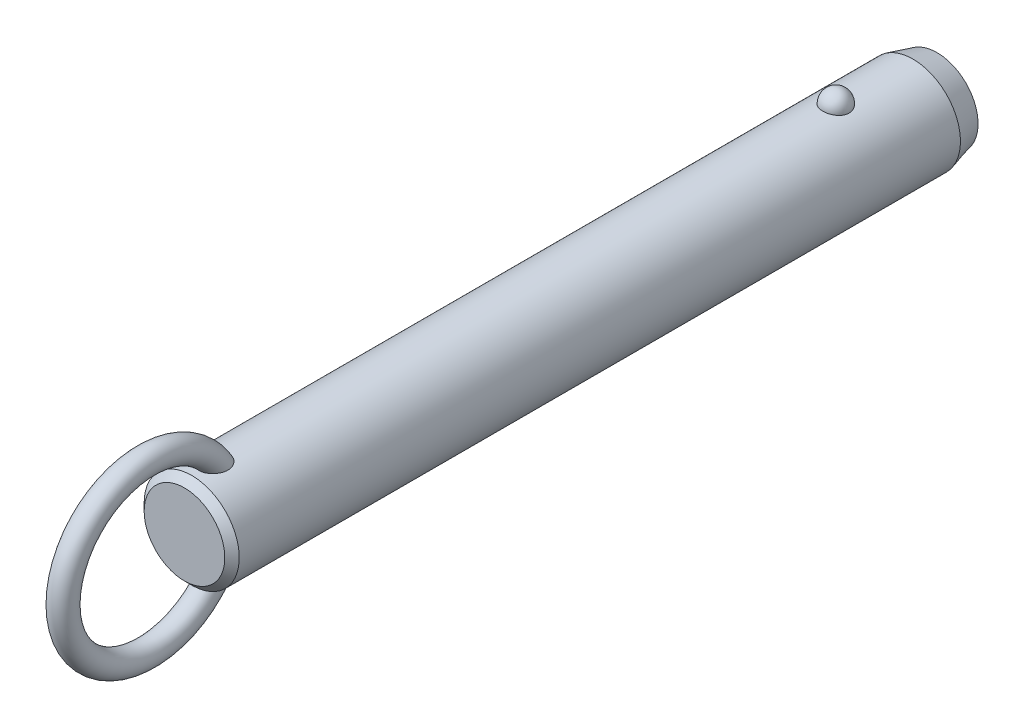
ISO-10303-21;
HEADER;
FILE_DESCRIPTION(('STEP AP214'),'2;1');
FILE_NAME('part.step','',(''),(''),'','','');
FILE_SCHEMA(('AUTOMOTIVE_DESIGN { 1 0 10303 214 1 1 1 1 }'));
ENDSEC;
DATA;
#1=APPLICATION_CONTEXT('core data for automotive mechanical design processes');
#2=APPLICATION_PROTOCOL_DEFINITION('international standard','automotive_design',2000,#1);
#3=PRODUCT_CONTEXT('',#1,'mechanical');
#4=PRODUCT('Part','Part','',(#3));
#5=PRODUCT_RELATED_PRODUCT_CATEGORY('part','',(#4));
#6=PRODUCT_DEFINITION_FORMATION('','',#4);
#7=PRODUCT_DEFINITION_CONTEXT('part definition',#1,'design');
#8=PRODUCT_DEFINITION('design','',#6,#7);
#9=PRODUCT_DEFINITION_SHAPE('','',#8);
#10=(LENGTH_UNIT() NAMED_UNIT(*) SI_UNIT(.MILLI.,.METRE.));
#11=(NAMED_UNIT(*) PLANE_ANGLE_UNIT() SI_UNIT($,.RADIAN.));
#12=(NAMED_UNIT(*) SI_UNIT($,.STERADIAN.) SOLID_ANGLE_UNIT());
#13=UNCERTAINTY_MEASURE_WITH_UNIT(LENGTH_MEASURE(1.E-05),#10,'distance_accuracy_value','');
#14=(GEOMETRIC_REPRESENTATION_CONTEXT(3) GLOBAL_UNCERTAINTY_ASSIGNED_CONTEXT((#13)) GLOBAL_UNIT_ASSIGNED_CONTEXT((#10,
#11,#12)) REPRESENTATION_CONTEXT('',''));
#15=CARTESIAN_POINT('',(0.,0.,0.));
#16=DIRECTION('',(0.,0.,1.));
#17=DIRECTION('',(1.,0.,0.));
#18=AXIS2_PLACEMENT_3D('',#15,#16,#17);
#19=CARTESIAN_POINT('',(0.,0.,96.5));
#20=DIRECTION('',(0.,0.,-1.));
#21=DIRECTION('',(-1.,0.,0.));
#22=AXIS2_PLACEMENT_3D('',#19,#20,#21);
#23=CYLINDRICAL_SURFACE('',#22,7.9);
#24=CARTESIAN_POINT('',(2.1785689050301,7.59367088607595,-2.19999999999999));
#25=CARTESIAN_POINT('',(2.17856679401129,7.59367269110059,-2.07701843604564));
#26=CARTESIAN_POINT('',(2.16853481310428,7.59657145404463,-1.95401006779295));
#27=CARTESIAN_POINT('',(2.12864689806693,7.607843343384,-1.71147811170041));
#28=CARTESIAN_POINT('',(2.09878338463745,7.61621856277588,-1.59195587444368));
#29=CARTESIAN_POINT('',(2.0199931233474,7.63749180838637,-1.3598563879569));
#30=CARTESIAN_POINT('',(1.97107475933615,7.6503878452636,-1.24727610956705));
#31=CARTESIAN_POINT('',(1.85539377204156,7.67926115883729,-1.03213234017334));
#32=CARTESIAN_POINT('',(1.78863158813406,7.69523835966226,-0.929568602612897));
#33=CARTESIAN_POINT('',(1.63856494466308,7.7285848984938,-0.736786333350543));
#34=CARTESIAN_POINT('',(1.55518140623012,7.7459606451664,-0.646630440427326));
#35=CARTESIAN_POINT('',(1.37422937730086,7.78009978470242,-0.481747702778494));
#36=CARTESIAN_POINT('',(1.27666086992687,7.79686317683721,-0.407020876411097));
#37=CARTESIAN_POINT('',(1.07024728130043,7.82786153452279,-0.275278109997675));
#38=CARTESIAN_POINT('',(0.961434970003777,7.84210353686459,-0.218212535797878));
#39=CARTESIAN_POINT('',(0.735351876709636,7.86652194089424,-0.123146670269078));
#40=CARTESIAN_POINT('',(0.618082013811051,7.87669878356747,-0.085144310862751));
#41=CARTESIAN_POINT('',(0.380637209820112,7.89170521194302,-0.0298158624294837));
#42=CARTESIAN_POINT('',(0.260550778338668,7.89662650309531,-0.0121347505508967));
#43=CARTESIAN_POINT('',(0.0190117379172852,7.90090003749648,0.00324379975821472));
#44=CARTESIAN_POINT('',(-0.102440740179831,7.90025280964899,0.00094313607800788));
#45=CARTESIAN_POINT('',(-0.341452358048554,7.89351056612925,-0.0233955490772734));
#46=CARTESIAN_POINT('',(-0.459042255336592,7.88749257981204,-0.0451545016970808));
#47=CARTESIAN_POINT('',(-0.688796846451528,7.87075812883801,-0.107408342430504));
#48=CARTESIAN_POINT('',(-0.800961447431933,7.86004158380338,-0.147903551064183));
#49=CARTESIAN_POINT('',(-1.01743634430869,7.83497131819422,-0.246799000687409));
#50=CARTESIAN_POINT('',(-1.12169791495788,7.82059709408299,-0.305300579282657));
#51=CARTESIAN_POINT('',(-1.31891765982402,7.78976470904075,-0.438549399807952));
#52=CARTESIAN_POINT('',(-1.41187469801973,7.77330633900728,-0.513298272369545));
#53=CARTESIAN_POINT('',(-1.58577142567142,7.73972434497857,-0.678622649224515));
#54=CARTESIAN_POINT('',(-1.66645140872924,7.72259402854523,-0.769470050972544));
#55=CARTESIAN_POINT('',(-1.81161503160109,7.68983776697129,-0.963538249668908));
#56=CARTESIAN_POINT('',(-1.87609753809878,7.6742119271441,-1.06675991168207));
#57=CARTESIAN_POINT('',(-1.98790138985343,7.6460202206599,-1.28401170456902));
#58=CARTESIAN_POINT('',(-2.03501994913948,7.63349104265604,-1.39815107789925));
#59=CARTESIAN_POINT('',(-2.10986724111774,7.6131449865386,-1.63301784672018));
#60=CARTESIAN_POINT('',(-2.1375965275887,7.60532797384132,-1.75374505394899));
#61=CARTESIAN_POINT('',(-2.17289256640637,7.5953195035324,-1.99782562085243));
#62=CARTESIAN_POINT('',(-2.18054294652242,7.59310471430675,-2.12116592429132));
#63=CARTESIAN_POINT('',(-2.17572919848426,7.59448538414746,-2.36741799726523));
#64=CARTESIAN_POINT('',(-2.1632656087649,7.59808068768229,-2.49032977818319));
#65=CARTESIAN_POINT('',(-2.11865035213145,7.61064035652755,-2.73161015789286));
#66=CARTESIAN_POINT('',(-2.08659579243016,7.61957823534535,-2.84999812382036));
#67=CARTESIAN_POINT('',(-2.00367799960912,7.64179982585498,-3.07955956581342));
#68=CARTESIAN_POINT('',(-1.9528140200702,7.65508371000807,-3.19073275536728));
#69=CARTESIAN_POINT('',(-1.83321113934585,7.68460381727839,-3.40337899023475));
#70=CARTESIAN_POINT('',(-1.76437735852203,7.70085556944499,-3.50479651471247));
#71=CARTESIAN_POINT('',(-1.61069526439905,7.73445734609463,-3.69446912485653));
#72=CARTESIAN_POINT('',(-1.52584634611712,7.75180741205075,-3.78272371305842));
#73=CARTESIAN_POINT('',(-1.34198059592,7.78574608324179,-3.94393987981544));
#74=CARTESIAN_POINT('',(-1.24291308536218,7.80233167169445,-4.01684434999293));
#75=CARTESIAN_POINT('',(-1.03352039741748,7.83281625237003,-4.14489386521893));
#76=CARTESIAN_POINT('',(-0.92319600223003,7.84671543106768,-4.20004014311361));
#77=CARTESIAN_POINT('',(-0.695822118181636,7.87011575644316,-4.29042017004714));
#78=CARTESIAN_POINT('',(-0.578872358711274,7.87966903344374,-4.32589112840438));
#79=CARTESIAN_POINT('',(-0.340410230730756,7.8935652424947,-4.37692226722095));
#80=CARTESIAN_POINT('',(-0.218898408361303,7.89790879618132,-4.39248482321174));
#81=CARTESIAN_POINT('',(0.0228107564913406,7.90087453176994,-4.40314405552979));
#82=CARTESIAN_POINT('',(0.142990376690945,7.89960185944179,-4.39861683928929));
#83=CARTESIAN_POINT('',(0.380829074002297,7.89171262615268,-4.37008293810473));
#84=CARTESIAN_POINT('',(0.498488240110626,7.8850962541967,-4.34607694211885));
#85=CARTESIAN_POINT('',(0.727535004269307,7.86726442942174,-4.27939317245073));
#86=CARTESIAN_POINT('',(0.838944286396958,7.85606616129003,-4.236785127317));
#87=CARTESIAN_POINT('',(1.05295421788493,7.83025654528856,-4.13408348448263));
#88=CARTESIAN_POINT('',(1.15555431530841,7.81564498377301,-4.07398879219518));
#89=CARTESIAN_POINT('',(1.35076763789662,7.7843022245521,-3.93687432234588));
#90=CARTESIAN_POINT('',(1.4432046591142,7.76754209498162,-3.85961036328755));
#91=CARTESIAN_POINT('',(1.6139111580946,7.73387857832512,-3.69076949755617));
#92=CARTESIAN_POINT('',(1.6921781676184,7.71697516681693,-3.59919010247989));
#93=CARTESIAN_POINT('',(1.83380875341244,7.6845643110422,-3.40247278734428));
#94=CARTESIAN_POINT('',(1.89689280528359,7.66908588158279,-3.29712873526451));
#95=CARTESIAN_POINT('',(2.0047823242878,7.64159441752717,-3.07707931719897));
#96=CARTESIAN_POINT('',(2.0495945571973,7.62958010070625,-2.96237743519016));
#97=CARTESIAN_POINT('',(2.11580183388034,7.61146617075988,-2.74040519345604));
#98=CARTESIAN_POINT('',(2.13929812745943,7.60484503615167,-2.63379846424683));
#99=CARTESIAN_POINT('',(2.17068242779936,7.59594664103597,-2.41813481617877));
#100=CARTESIAN_POINT('',(2.17857077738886,7.59366928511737,-2.30907795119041));
#101=CARTESIAN_POINT('',(2.1785689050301,7.59367088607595,-2.19999999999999));
#102=B_SPLINE_CURVE_WITH_KNOTS('',3,(#24,#25,#26,#27,#28,#29,#30,#31,#32,#33,#34,#35,#36,#37,
#38,#39,#40,#41,#42,#43,#44,#45,#46,#47,#48,#49,#50,#51,#52,#53,#54,#55,#56,#57,#58,#59,#60,#61,
#62,#63,#64,#65,#66,#67,#68,#69,#70,#71,#72,#73,#74,#75,#76,#77,#78,#79,#80,#81,#82,#83,#84,#85,
#86,#87,#88,#89,#90,#91,#92,#93,#94,#95,#96,#97,#98,#99,#100,#101),.UNSPECIFIED.,.T.,.F.,(4,2,2,
2,2,2,2,2,2,2,2,2,2,2,2,2,2,2,2,2,2,2,2,2,2,2,2,2,2,2,2,2,2,2,2,2,2,2,4),(0.,0.368552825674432,
0.737246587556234,1.10577831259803,1.4743009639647,1.8446206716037,2.21494081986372,
2.5842105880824,2.95344028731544,3.31611630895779,3.67875788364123,4.03628044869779,
4.39380913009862,4.75338791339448,5.11300280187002,5.47939989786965,5.8458226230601,
6.21639834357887,6.58696347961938,6.95598276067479,7.32499216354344,7.69218715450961,
8.0593967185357,8.42858578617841,8.79778880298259,9.16834203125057,9.5388695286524,
9.90482699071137,10.2707407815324,10.6298333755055,10.9889132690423,11.3466585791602,
11.7044262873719,12.0676511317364,12.4309391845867,12.8004764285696,13.1698767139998,
13.4967701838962,13.8236564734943),.UNSPECIFIED.);
#103=CARTESIAN_POINT('',(2.1785689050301,7.59367088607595,-2.19999999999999));
#104=VERTEX_POINT('',#103);
#105=EDGE_CURVE('E41',#104,#104,#102,.T.);
#106=ORIENTED_EDGE('',*,*,#105,.T.);
#107=EDGE_LOOP('',(#106));
#108=FACE_BOUND('',#107,.T.);
#109=CARTESIAN_POINT('',(0.,0.,104.82));
#110=DIRECTION('',(0.,0.,1.));
#111=DIRECTION('',(1.,0.,0.));
#112=AXIS2_PLACEMENT_3D('',#109,#110,#111);
#113=CIRCLE('',#112,7.9);
#114=CARTESIAN_POINT('',(-7.90000000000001,0.,104.82));
#115=VERTEX_POINT('',#114);
#116=EDGE_CURVE('E10',#115,#115,#113,.F.);
#117=ORIENTED_EDGE('',*,*,#116,.T.);
#118=EDGE_LOOP('',(#117));
#119=FACE_BOUND('',#118,.T.);
#120=CARTESIAN_POINT('',(-0.630969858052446,-7.87476203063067,98.7124322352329));
#121=CARTESIAN_POINT('',(-0.73418033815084,-7.8664899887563,98.747285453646));
#122=CARTESIAN_POINT('',(-0.834476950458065,-7.85639291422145,98.7908160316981));
#123=CARTESIAN_POINT('',(-1.02620356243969,-7.83366343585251,98.8940948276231));
#124=CARTESIAN_POINT('',(-1.1176141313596,-7.82102565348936,98.9538775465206));
#125=CARTESIAN_POINT('',(-1.28877277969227,-7.79464922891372,99.0878390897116));
#126=CARTESIAN_POINT('',(-1.36854014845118,-7.78091246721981,99.161993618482));
#127=CARTESIAN_POINT('',(-1.5146152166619,-7.75380398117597,99.3224941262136));
#128=CARTESIAN_POINT('',(-1.58092966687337,-7.74043207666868,99.4088339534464));
#129=CARTESIAN_POINT('',(-1.70019064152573,-7.71512522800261,99.5929784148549));
#130=CARTESIAN_POINT('',(-1.75284037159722,-7.70322473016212,99.6909792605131));
#131=CARTESIAN_POINT('',(-1.84263464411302,-7.68224112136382,99.8941029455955));
#132=CARTESIAN_POINT('',(-1.87977299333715,-7.6731591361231,99.9992286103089));
#133=CARTESIAN_POINT('',(-1.94152728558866,-7.65777930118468,100.223284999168));
#134=CARTESIAN_POINT('',(-1.96475471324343,-7.65179654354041,100.342616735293));
#135=CARTESIAN_POINT('',(-1.99449499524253,-7.64409642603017,100.58342986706));
#136=CARTESIAN_POINT('',(-2.0010005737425,-7.64238092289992,100.704912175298));
#137=CARTESIAN_POINT('',(-1.99856014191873,-7.64302120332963,100.968340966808));
#138=CARTESIAN_POINT('',(-1.98680021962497,-7.64611845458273,101.11025654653));
#139=CARTESIAN_POINT('',(-1.94457772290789,-7.65696186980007,101.391118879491));
#140=CARTESIAN_POINT('',(-1.91409393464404,-7.66471330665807,101.530062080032));
#141=CARTESIAN_POINT('',(-1.82768670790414,-7.68582947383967,101.831939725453));
#142=CARTESIAN_POINT('',(-1.76772963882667,-7.70003779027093,101.993686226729));
#143=CARTESIAN_POINT('',(-1.65998501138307,-7.72371550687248,102.227695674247));
#144=CARTESIAN_POINT('',(-1.621079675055,-7.73200670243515,102.304297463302));
#145=CARTESIAN_POINT('',(-1.53727726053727,-7.74910377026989,102.454079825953));
#146=CARTESIAN_POINT('',(-1.49238215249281,-7.75790947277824,102.527261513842));
#147=CARTESIAN_POINT('',(-1.3739705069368,-7.77993338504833,102.70288382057));
#148=CARTESIAN_POINT('',(-1.29690364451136,-7.79328473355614,102.802955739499));
#149=CARTESIAN_POINT('',(-1.1288548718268,-7.81939266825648,102.990714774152));
#150=CARTESIAN_POINT('',(-1.03789926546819,-7.83215032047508,103.078424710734));
#151=CARTESIAN_POINT('',(-0.869532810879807,-7.85231710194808,103.213414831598));
#152=CARTESIAN_POINT('',(-0.795716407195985,-7.86021093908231,103.265076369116));
#153=CARTESIAN_POINT('',(-0.64081313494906,-7.87434920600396,103.356381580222));
#154=CARTESIAN_POINT('',(-0.55973779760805,-7.88059619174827,103.39604389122));
#155=CARTESIAN_POINT('',(-0.406456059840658,-7.88984116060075,103.454300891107));
#156=CARTESIAN_POINT('',(-0.335227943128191,-7.89321892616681,103.475384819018));
#157=CARTESIAN_POINT('',(-0.19019307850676,-7.89804235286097,103.50541418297));
#158=CARTESIAN_POINT('',(-0.11638863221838,-7.89948969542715,103.514370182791));
#159=CARTESIAN_POINT('',(0.0318414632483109,-7.90028409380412,103.519291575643));
#160=CARTESIAN_POINT('',(0.106268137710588,-7.89962640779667,103.515227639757));
#161=CARTESIAN_POINT('',(0.253290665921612,-7.8962818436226,103.494461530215));
#162=CARTESIAN_POINT('',(0.32588518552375,-7.8935935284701,103.477750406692));
#163=CARTESIAN_POINT('',(0.481441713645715,-7.88577340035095,103.428738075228));
#164=CARTESIAN_POINT('',(0.563611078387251,-7.88026321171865,103.394005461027));
#165=CARTESIAN_POINT('',(0.721129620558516,-7.86741729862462,103.311796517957));
#166=CARTESIAN_POINT('',(0.796466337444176,-7.86007832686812,103.264297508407));
#167=CARTESIAN_POINT('',(0.971456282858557,-7.84073285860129,103.136513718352));
#168=CARTESIAN_POINT('',(1.0671968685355,-7.82809461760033,103.051004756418));
#169=CARTESIAN_POINT('',(1.24418921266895,-7.80192439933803,102.866232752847));
#170=CARTESIAN_POINT('',(1.32540832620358,-7.78839049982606,102.766939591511));
#171=CARTESIAN_POINT('',(1.45199971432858,-7.76559693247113,102.589576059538));
#172=CARTESIAN_POINT('',(1.50085649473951,-7.75626094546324,102.513954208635));
#173=CARTESIAN_POINT('',(1.59197749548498,-7.7380727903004,102.358742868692));
#174=CARTESIAN_POINT('',(1.63423919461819,-7.72922080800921,102.279151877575));
#175=CARTESIAN_POINT('',(1.71222612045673,-7.71231959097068,102.116664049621));
#176=CARTESIAN_POINT('',(1.74794516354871,-7.70427111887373,102.033764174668));
#177=CARTESIAN_POINT('',(1.81270113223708,-7.68929240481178,101.865296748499));
#178=CARTESIAN_POINT('',(1.84173789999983,-7.68236218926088,101.779729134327));
#179=CARTESIAN_POINT('',(1.89322698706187,-7.66983757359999,101.60528702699));
#180=CARTESIAN_POINT('',(1.91558744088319,-7.66426199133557,101.516383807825));
#181=CARTESIAN_POINT('',(1.95281367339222,-7.65485915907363,101.336969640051));
#182=CARTESIAN_POINT('',(1.96767946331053,-7.65103190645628,101.246458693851));
#183=CARTESIAN_POINT('',(2.00021456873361,-7.64262981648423,100.973732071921));
#184=CARTESIAN_POINT('',(2.00600691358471,-7.6410871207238,100.789709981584));
#185=CARTESIAN_POINT('',(1.98445334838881,-7.64669564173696,100.476501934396));
#186=CARTESIAN_POINT('',(1.96607186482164,-7.65149688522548,100.346618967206));
#187=CARTESIAN_POINT('',(1.90884967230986,-7.6659762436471,100.091632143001));
#188=CARTESIAN_POINT('',(1.8700210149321,-7.67565148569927,99.966525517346));
#189=CARTESIAN_POINT('',(1.77063986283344,-7.69918471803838,99.7245401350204));
#190=CARTESIAN_POINT('',(1.70993724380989,-7.71307150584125,99.6077250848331));
#191=CARTESIAN_POINT('',(1.5673307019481,-7.74330306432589,99.3881444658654));
#192=CARTESIAN_POINT('',(1.48543692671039,-7.75964665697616,99.2853722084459));
#193=CARTESIAN_POINT('',(1.31346177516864,-7.79047523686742,99.1093800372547));
#194=CARTESIAN_POINT('',(1.22547278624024,-7.80495298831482,99.0341066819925));
#195=CARTESIAN_POINT('',(1.03724352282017,-7.83218597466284,98.9004864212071));
#196=CARTESIAN_POINT('',(0.937008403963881,-7.84494192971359,98.8421324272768));
#197=CARTESIAN_POINT('',(0.733599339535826,-7.86649045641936,98.7470270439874));
#198=CARTESIAN_POINT('',(0.630941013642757,-7.87547134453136,98.7092109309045));
#199=CARTESIAN_POINT('',(0.420465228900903,-7.88950708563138,98.6511160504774));
#200=CARTESIAN_POINT('',(0.312645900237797,-7.89456050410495,98.6308436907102));
#201=CARTESIAN_POINT('',(0.0960869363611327,-7.9001518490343,98.6084559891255));
#202=CARTESIAN_POINT('',(-0.0126341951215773,-7.90073226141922,98.6061698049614));
#203=CARTESIAN_POINT('',(-0.228766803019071,-7.89742350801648,98.6193678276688));
#204=CARTESIAN_POINT('',(-0.336180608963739,-7.89354403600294,98.6348134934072));
#205=CARTESIAN_POINT('',(-0.473410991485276,-7.88586871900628,98.6662177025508));
#206=CARTESIAN_POINT('',(-0.50525779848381,-7.88388984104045,98.6743541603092));
#207=CARTESIAN_POINT('',(-0.5684812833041,-7.87958326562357,98.6922083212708));
#208=CARTESIAN_POINT('',(-0.599857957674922,-7.87725556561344,98.7019260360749));
#209=CARTESIAN_POINT('',(-0.630969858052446,-7.87476203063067,98.7124322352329));
#210=B_SPLINE_CURVE_WITH_KNOTS('',3,(#120,#121,#122,#123,#124,#125,#126,#127,#128,#129,#130,
#131,#132,#133,#134,#135,#136,#137,#138,#139,#140,#141,#142,#143,#144,#145,#146,#147,#148,#149,
#150,#151,#152,#153,#154,#155,#156,#157,#158,#159,#160,#161,#162,#163,#164,#165,#166,#167,#168,
#169,#170,#171,#172,#173,#174,#175,#176,#177,#178,#179,#180,#181,#182,#183,#184,#185,#186,#187,
#188,#189,#190,#191,#192,#193,#194,#195,#196,#197,#198,#199,#200,#201,#202,#203,#204,#205,#206,
#207,#208,#209),.UNSPECIFIED.,.T.,.F.,(4,2,2,2,2,2,2,2,2,2,2,2,2,2,2,2,2,2,2,2,2,2,2,2,2,2,2,2,
2,2,2,2,2,2,2,2,2,2,2,2,2,2,2,2,4),(0.,0.327622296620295,0.655945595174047,0.983718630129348,
1.3113267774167,1.64554655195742,1.9798996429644,2.3436572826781,2.70757317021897,
3.13333684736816,3.55958380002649,4.07655306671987,4.3352789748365,4.59391999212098,
4.97382437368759,5.35301797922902,5.62348245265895,5.89352465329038,6.11565959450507,
6.33760092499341,6.56004255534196,6.78264174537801,7.04930844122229,7.31645206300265,
7.70130871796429,8.08701995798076,8.3582450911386,8.62957365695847,8.90115735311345,
9.17274746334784,9.44791855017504,9.72308922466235,10.2715298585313,10.6638393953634,
11.0559179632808,11.4507403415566,11.845374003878,12.1936425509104,12.5417649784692,
12.8695063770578,13.1973674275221,13.5221104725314,13.8461490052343,13.9449071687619,
14.0436660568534),.UNSPECIFIED.);
#211=CARTESIAN_POINT('',(-0.630969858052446,-7.87476203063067,98.7124322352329));
#212=VERTEX_POINT('',#211);
#213=EDGE_CURVE('E59',#212,#212,#210,.T.);
#214=ORIENTED_EDGE('',*,*,#213,.T.);
#215=EDGE_LOOP('',(#214));
#216=FACE_BOUND('',#215,.T.);
#217=CARTESIAN_POINT('',(-0.630969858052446,7.87476203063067,98.7124322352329));
#218=CARTESIAN_POINT('',(-0.528918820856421,7.88293636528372,98.6779798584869));
#219=CARTESIAN_POINT('',(-0.42374551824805,7.8893481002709,98.651915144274));
#220=CARTESIAN_POINT('',(-0.210236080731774,7.8979273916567,98.6172825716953));
#221=CARTESIAN_POINT('',(-0.10189380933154,7.90008607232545,98.6087513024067));
#222=CARTESIAN_POINT('',(0.114660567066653,7.89990877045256,98.6094570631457));
#223=CARTESIAN_POINT('',(0.222872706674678,7.89757640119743,98.6186798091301));
#224=CARTESIAN_POINT('',(0.436107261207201,7.88867538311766,98.6546525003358));
#225=CARTESIAN_POINT('',(0.541131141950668,7.8821087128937,98.6813942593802));
#226=CARTESIAN_POINT('',(0.745085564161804,7.86545130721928,98.7517561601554));
#227=CARTESIAN_POINT('',(0.844015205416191,7.85536005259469,98.7953787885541));
#228=CARTESIAN_POINT('',(1.03299167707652,7.83275153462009,98.8983796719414));
#229=CARTESIAN_POINT('',(1.12303841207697,7.8202342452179,98.9577580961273));
#230=CARTESIAN_POINT('',(1.29214734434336,7.79408219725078,99.0908647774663));
#231=CARTESIAN_POINT('',(1.37116907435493,7.78044359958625,99.1646436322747));
#232=CARTESIAN_POINT('',(1.51597677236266,7.75353170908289,99.3242353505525));
#233=CARTESIAN_POINT('',(1.58176261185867,7.74025841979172,99.4100483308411));
#234=CARTESIAN_POINT('',(1.70057386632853,7.71504069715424,99.593644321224));
#235=CARTESIAN_POINT('',(1.75320073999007,7.70314257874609,99.6916906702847));
#236=CARTESIAN_POINT('',(1.84293767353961,7.68216822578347,99.8948931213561));
#237=CARTESIAN_POINT('',(1.88004278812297,7.67309289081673,100.000051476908));
#238=CARTESIAN_POINT('',(1.9417232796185,7.6577294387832,100.224167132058));
#239=CARTESIAN_POINT('',(1.96491037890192,7.65175648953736,100.343524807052));
#240=CARTESIAN_POINT('',(1.9945689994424,7.64407702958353,100.584384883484));
#241=CARTESIAN_POINT('',(2.00103304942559,7.64237242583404,100.70588821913));
#242=CARTESIAN_POINT('',(1.9985016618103,7.64303650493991,100.969368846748));
#243=CARTESIAN_POINT('',(1.98669038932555,7.64614714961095,101.111314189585));
#244=CARTESIAN_POINT('',(1.94436120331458,7.6570170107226,101.392228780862));
#245=CARTESIAN_POINT('',(1.9138220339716,7.66478150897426,101.531194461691));
#246=CARTESIAN_POINT('',(1.82728754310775,7.68592483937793,101.833111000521));
#247=CARTESIAN_POINT('',(1.76725778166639,7.7001468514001,101.994872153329));
#248=CARTESIAN_POINT('',(1.65939700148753,7.72384204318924,102.228891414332));
#249=CARTESIAN_POINT('',(1.62045187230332,7.73213852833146,102.305494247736));
#250=CARTESIAN_POINT('',(1.53656684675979,7.74924489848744,102.455273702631));
#251=CARTESIAN_POINT('',(1.49162892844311,7.75805461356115,102.528451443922));
#252=CARTESIAN_POINT('',(1.37317698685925,7.78007342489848,102.703952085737));
#253=CARTESIAN_POINT('',(1.29612360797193,7.79341423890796,102.803911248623));
#254=CARTESIAN_POINT('',(1.12812043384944,7.81949839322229,102.99145083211));
#255=CARTESIAN_POINT('',(1.03719688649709,7.83224280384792,103.079054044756));
#256=CARTESIAN_POINT('',(0.868871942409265,7.85239026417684,103.21389715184));
#257=CARTESIAN_POINT('',(0.795056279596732,7.86027769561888,103.265511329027));
#258=CARTESIAN_POINT('',(0.640160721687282,7.87440222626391,103.356720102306));
#259=CARTESIAN_POINT('',(0.559092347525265,7.88064188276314,103.396333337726));
#260=CARTESIAN_POINT('',(0.405820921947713,7.8898738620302,103.454505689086));
#261=CARTESIAN_POINT('',(0.334594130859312,7.89324577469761,103.475552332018));
#262=CARTESIAN_POINT('',(0.189568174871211,7.89805733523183,103.505507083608));
#263=CARTESIAN_POINT('',(0.115771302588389,7.89949866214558,103.514425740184));
#264=CARTESIAN_POINT('',(-0.0324359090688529,7.90028156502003,103.51927589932));
#265=CARTESIAN_POINT('',(-0.106847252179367,7.89961843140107,103.515178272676));
#266=CARTESIAN_POINT('',(-0.253834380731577,7.8962642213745,103.494351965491));
#267=CARTESIAN_POINT('',(-0.326408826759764,7.89357170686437,103.477614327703));
#268=CARTESIAN_POINT('',(-0.481962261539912,7.88574179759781,103.428539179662));
#269=CARTESIAN_POINT('',(-0.564145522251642,7.88022507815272,103.393763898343));
#270=CARTESIAN_POINT('',(-0.721685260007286,7.86736646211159,103.311468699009));
#271=CARTESIAN_POINT('',(-0.797029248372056,7.8600213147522,103.263926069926));
#272=CARTESIAN_POINT('',(-0.972044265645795,7.84066026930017,103.136026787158));
#273=CARTESIAN_POINT('',(-1.06779803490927,7.82801274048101,103.050443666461));
#274=CARTESIAN_POINT('',(-1.24480531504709,7.80182621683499,102.865522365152));
#275=CARTESIAN_POINT('',(-1.32602618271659,7.78828530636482,102.766154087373));
#276=CARTESIAN_POINT('',(-1.45259834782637,7.76548487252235,102.588680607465));
#277=CARTESIAN_POINT('',(-1.50143856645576,7.75614818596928,102.513025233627));
#278=CARTESIAN_POINT('',(-1.59252410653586,7.73796020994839,102.357748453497));
#279=CARTESIAN_POINT('',(-1.63476690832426,7.72910910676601,102.278125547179));
#280=CARTESIAN_POINT('',(-1.71271318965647,7.71221133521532,102.115575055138));
#281=CARTESIAN_POINT('',(-1.7484104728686,7.70416543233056,102.032644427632));
#282=CARTESIAN_POINT('',(-1.81311929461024,7.6891937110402,101.864116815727));
#283=CARTESIAN_POINT('',(-1.84213067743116,7.6822679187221,101.778519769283));
#284=CARTESIAN_POINT('',(-1.89356259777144,7.66975461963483,101.604025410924));
#285=CARTESIAN_POINT('',(-1.91589165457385,7.66418586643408,101.515099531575));
#286=CARTESIAN_POINT('',(-1.95305070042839,7.65479859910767,101.335642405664));
#287=CARTESIAN_POINT('',(-1.96788069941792,7.65098008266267,101.245111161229));
#288=CARTESIAN_POINT('',(-2.00030078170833,7.64260704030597,100.972327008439));
#289=CARTESIAN_POINT('',(-2.00600576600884,7.64108760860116,100.788271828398));
#290=CARTESIAN_POINT('',(-1.98428483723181,7.64673945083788,100.475080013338));
#291=CARTESIAN_POINT('',(-1.96583698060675,7.6515575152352,100.345240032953));
#292=CARTESIAN_POINT('',(-1.90848948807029,7.66606613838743,100.090361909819));
#293=CARTESIAN_POINT('',(-1.86960376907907,7.67575338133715,99.965320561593));
#294=CARTESIAN_POINT('',(-1.7701342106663,7.69930132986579,99.7235009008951));
#295=CARTESIAN_POINT('',(-1.70940488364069,7.71318991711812,99.6067844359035));
#296=CARTESIAN_POINT('',(-1.56672953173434,7.74342495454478,99.3873404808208));
#297=CARTESIAN_POINT('',(-1.48478316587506,7.75977144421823,99.2846132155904));
#298=CARTESIAN_POINT('',(-1.31266325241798,7.79061163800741,99.1086431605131));
#299=CARTESIAN_POINT('',(-1.22456383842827,7.80509908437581,99.0333589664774));
#300=CARTESIAN_POINT('',(-1.03622400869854,7.83231881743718,98.8998659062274));
#301=CARTESIAN_POINT('',(-0.936015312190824,7.84505551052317,98.8416137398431));
#302=CARTESIAN_POINT('',(-0.798824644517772,7.85957802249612,98.7775408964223));
#303=CARTESIAN_POINT('',(-0.765787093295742,7.86286821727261,98.7632248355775));
#304=CARTESIAN_POINT('',(-0.698939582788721,7.86909211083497,98.736436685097));
#305=CARTESIAN_POINT('',(-0.665129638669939,7.8720258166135,98.7239645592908));
#306=CARTESIAN_POINT('',(-0.630969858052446,7.87476203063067,98.7124322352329));
#307=B_SPLINE_CURVE_WITH_KNOTS('',3,(#217,#218,#219,#220,#221,#222,#223,#224,#225,#226,#227,
#228,#229,#230,#231,#232,#233,#234,#235,#236,#237,#238,#239,#240,#241,#242,#243,#244,#245,#246,
#247,#248,#249,#250,#251,#252,#253,#254,#255,#256,#257,#258,#259,#260,#261,#262,#263,#264,#265,
#266,#267,#268,#269,#270,#271,#272,#273,#274,#275,#276,#277,#278,#279,#280,#281,#282,#283,#284,
#285,#286,#287,#288,#289,#290,#291,#292,#293,#294,#295,#296,#297,#298,#299,#300,#301,#302,#303,
#304,#305,#306),.UNSPECIFIED.,.T.,.F.,(4,2,2,2,2,2,2,2,2,2,2,2,2,2,2,2,2,2,2,2,2,2,2,2,2,2,2,2,
2,2,2,2,2,2,2,2,2,2,2,2,2,2,2,2,4),(0.,0.323920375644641,0.648516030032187,0.97285063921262,
1.29703380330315,1.62126473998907,1.94549915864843,2.27089401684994,2.5962920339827,
2.93059633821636,3.26500707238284,3.62881644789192,3.99278833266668,4.41865421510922,
4.84500434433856,5.36209210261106,5.62087589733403,5.87957448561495,6.25918598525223,
6.63808782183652,6.90846748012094,7.17842501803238,7.40052350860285,7.62242871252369,
7.84483086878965,8.06739077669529,8.33414615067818,8.60137921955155,8.98641454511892,
9.3723041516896,9.64358673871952,9.91497268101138,10.1866142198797,10.4582620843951,
10.7334745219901,11.0086865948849,11.5572126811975,11.9494246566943,12.3413699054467,
12.7359755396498,13.1305875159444,13.4791770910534,13.82687259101,13.9353013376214,
14.0437279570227),.UNSPECIFIED.);
#308=CARTESIAN_POINT('',(-0.630969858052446,7.87476203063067,98.7124322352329));
#309=VERTEX_POINT('',#308);
#310=EDGE_CURVE('E67',#309,#309,#307,.T.);
#311=ORIENTED_EDGE('',*,*,#310,.T.);
#312=EDGE_LOOP('',(#311));
#313=FACE_BOUND('',#312,.T.);
#314=CARTESIAN_POINT('',(0.,0.,-14.9999999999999));
#315=DIRECTION('',(0.,0.,-1.));
#316=DIRECTION('',(-1.,0.,0.));
#317=AXIS2_PLACEMENT_3D('',#314,#315,#316);
#318=CIRCLE('',#317,7.9);
#319=CARTESIAN_POINT('',(-7.9,0.,-14.9999999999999));
#320=VERTEX_POINT('',#319);
#321=EDGE_CURVE('E56',#320,#320,#318,.F.);
#322=ORIENTED_EDGE('',*,*,#321,.T.);
#323=EDGE_LOOP('',(#322));
#324=FACE_BOUND('',#323,.T.);
#325=ADVANCED_FACE('F37',(#108,#119,#216,#313,#324),#23,.T.);
#326=CARTESIAN_POINT('',(0.,0.,-19.));
#327=DIRECTION('',(0.,0.,-1.));
#328=DIRECTION('',(-1.,0.,0.));
#329=AXIS2_PLACEMENT_3D('',#326,#327,#328);
#330=PLANE('',#329);
#331=CARTESIAN_POINT('',(0.,0.,-19.));
#332=DIRECTION('',(0.,0.,-1.));
#333=DIRECTION('',(-1.,0.,0.));
#334=AXIS2_PLACEMENT_3D('',#331,#332,#333);
#335=CIRCLE('',#334,6.82820323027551);
#336=CARTESIAN_POINT('',(-6.82820323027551,0.,-19.));
#337=VERTEX_POINT('',#336);
#338=EDGE_CURVE('E66',#337,#337,#335,.T.);
#339=ORIENTED_EDGE('',*,*,#338,.T.);
#340=EDGE_LOOP('',(#339));
#341=FACE_BOUND('',#340,.T.);
#342=ADVANCED_FACE('F85',(#341),#330,.T.);
#343=CARTESIAN_POINT('',(0.,0.,-19.));
#344=DIRECTION('',(0.,0.,1.));
#345=DIRECTION('',(1.,0.,0.));
#346=AXIS2_PLACEMENT_3D('',#343,#344,#345);
#347=CONICAL_SURFACE('',#346,6.8282032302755,0.261799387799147);
#348=ORIENTED_EDGE('',*,*,#321,.F.);
#349=EDGE_LOOP('',(#348));
#350=FACE_BOUND('',#349,.T.);
#351=ORIENTED_EDGE('',*,*,#338,.F.);
#352=EDGE_LOOP('',(#351));
#353=FACE_BOUND('',#352,.T.);
#354=ADVANCED_FACE('F83',(#350,#353),#347,.T.);
#355=CARTESIAN_POINT('',(0.,0.,106.02));
#356=DIRECTION('',(0.,0.,1.));
#357=DIRECTION('',(1.,0.,0.));
#358=AXIS2_PLACEMENT_3D('',#355,#356,#357);
#359=PLANE('',#358);
#360=CARTESIAN_POINT('',(0.,0.,106.02));
#361=DIRECTION('',(0.,0.,1.));
#362=DIRECTION('',(1.,0.,0.));
#363=AXIS2_PLACEMENT_3D('',#360,#361,#362);
#364=CIRCLE('',#363,6.69999999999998);
#365=CARTESIAN_POINT('',(-6.69999999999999,0.,106.02));
#366=VERTEX_POINT('',#365);
#367=EDGE_CURVE('E50',#366,#366,#364,.T.);
#368=ORIENTED_EDGE('',*,*,#367,.T.);
#369=EDGE_LOOP('',(#368));
#370=FACE_BOUND('',#369,.T.);
#371=ADVANCED_FACE('F77',(#370),#359,.T.);
#372=CARTESIAN_POINT('',(0.,0.,112.35));
#373=DIRECTION('',(1.,0.,0.));
#374=DIRECTION('',(0.,0.,-1.));
#375=AXIS2_PLACEMENT_3D('',#372,#373,#374);
#376=TOROIDAL_SURFACE('',#375,13.85,2.);
#377=ORIENTED_EDGE('',*,*,#310,.F.);
#378=EDGE_LOOP('',(#377));
#379=FACE_BOUND('',#378,.T.);
#380=ORIENTED_EDGE('',*,*,#213,.F.);
#381=EDGE_LOOP('',(#380));
#382=FACE_BOUND('',#381,.T.);
#383=ADVANCED_FACE('F73',(#379,#382),#376,.T.);
#384=CARTESIAN_POINT('',(0.,0.,106.02));
#385=DIRECTION('',(0.,0.,-1.));
#386=DIRECTION('',(-1.,0.,0.));
#387=AXIS2_PLACEMENT_3D('',#384,#385,#386);
#388=CONICAL_SURFACE('',#387,6.69999999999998,0.785398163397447);
#389=CARTESIAN_POINT('',(-7.90000000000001,0.,104.82));
#390=CARTESIAN_POINT('',(-7.88750000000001,0.,104.8325));
#391=CARTESIAN_POINT('',(-7.87500000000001,0.,104.845));
#392=CARTESIAN_POINT('',(-7.85,0.,104.87));
#393=CARTESIAN_POINT('',(-7.8375,0.,104.8825));
#394=CARTESIAN_POINT('',(-7.81250000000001,0.,104.9075));
#395=CARTESIAN_POINT('',(-7.80000000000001,0.,104.92));
#396=CARTESIAN_POINT('',(-7.77500000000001,0.,104.945));
#397=CARTESIAN_POINT('',(-7.76250000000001,0.,104.9575));
#398=CARTESIAN_POINT('',(-7.7375,0.,104.9825));
#399=CARTESIAN_POINT('',(-7.725,0.,104.995));
#400=CARTESIAN_POINT('',(-7.7,0.,105.02));
#401=CARTESIAN_POINT('',(-7.68750000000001,0.,105.0325));
#402=CARTESIAN_POINT('',(-7.66250000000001,0.,105.0575));
#403=CARTESIAN_POINT('',(-7.65,0.,105.07));
#404=CARTESIAN_POINT('',(-7.625,0.,105.095));
#405=CARTESIAN_POINT('',(-7.6125,0.,105.1075));
#406=CARTESIAN_POINT('',(-7.5875,0.,105.1325));
#407=CARTESIAN_POINT('',(-7.575,0.,105.145));
#408=CARTESIAN_POINT('',(-7.55,0.,105.17));
#409=CARTESIAN_POINT('',(-7.5375,0.,105.1825));
#410=CARTESIAN_POINT('',(-7.5125,0.,105.2075));
#411=CARTESIAN_POINT('',(-7.5,0.,105.22));
#412=CARTESIAN_POINT('',(-7.475,0.,105.245));
#413=CARTESIAN_POINT('',(-7.4625,0.,105.2575));
#414=CARTESIAN_POINT('',(-7.4375,0.,105.2825));
#415=CARTESIAN_POINT('',(-7.425,0.,105.295));
#416=CARTESIAN_POINT('',(-7.4,0.,105.32));
#417=CARTESIAN_POINT('',(-7.3875,0.,105.3325));
#418=CARTESIAN_POINT('',(-7.3625,0.,105.3575));
#419=CARTESIAN_POINT('',(-7.35,0.,105.37));
#420=CARTESIAN_POINT('',(-7.325,0.,105.395));
#421=CARTESIAN_POINT('',(-7.3125,0.,105.4075));
#422=CARTESIAN_POINT('',(-7.2875,0.,105.4325));
#423=CARTESIAN_POINT('',(-7.275,0.,105.445));
#424=CARTESIAN_POINT('',(-7.25,0.,105.47));
#425=CARTESIAN_POINT('',(-7.2375,0.,105.4825));
#426=CARTESIAN_POINT('',(-7.2125,0.,105.5075));
#427=CARTESIAN_POINT('',(-7.2,0.,105.52));
#428=CARTESIAN_POINT('',(-7.175,0.,105.545));
#429=CARTESIAN_POINT('',(-7.1625,0.,105.5575));
#430=CARTESIAN_POINT('',(-7.1375,0.,105.5825));
#431=CARTESIAN_POINT('',(-7.125,0.,105.595));
#432=CARTESIAN_POINT('',(-7.1,0.,105.62));
#433=CARTESIAN_POINT('',(-7.0875,0.,105.6325));
#434=CARTESIAN_POINT('',(-7.06249999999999,0.,105.6575));
#435=CARTESIAN_POINT('',(-7.04999999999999,0.,105.67));
#436=CARTESIAN_POINT('',(-7.02499999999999,0.,105.695));
#437=CARTESIAN_POINT('',(-7.0125,0.,105.7075));
#438=CARTESIAN_POINT('',(-6.9875,0.,105.7325));
#439=CARTESIAN_POINT('',(-6.975,0.,105.745));
#440=CARTESIAN_POINT('',(-6.94999999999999,0.,105.77));
#441=CARTESIAN_POINT('',(-6.93749999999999,0.,105.7825));
#442=CARTESIAN_POINT('',(-6.91249999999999,0.,105.8075));
#443=CARTESIAN_POINT('',(-6.9,0.,105.82));
#444=CARTESIAN_POINT('',(-6.87499999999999,0.,105.845));
#445=CARTESIAN_POINT('',(-6.86249999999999,0.,105.8575));
#446=CARTESIAN_POINT('',(-6.83749999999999,0.,105.8825));
#447=CARTESIAN_POINT('',(-6.82499999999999,0.,105.895));
#448=CARTESIAN_POINT('',(-6.79999999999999,0.,105.92));
#449=CARTESIAN_POINT('',(-6.78749999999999,0.,105.9325));
#450=CARTESIAN_POINT('',(-6.76249999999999,0.,105.9575));
#451=CARTESIAN_POINT('',(-6.74999999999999,0.,105.97));
#452=CARTESIAN_POINT('',(-6.72499999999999,0.,105.995));
#453=CARTESIAN_POINT('',(-6.71249999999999,0.,106.0075));
#454=CARTESIAN_POINT('',(-6.69999999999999,0.,106.02));
#455=B_SPLINE_CURVE_WITH_KNOTS('',3,(#389,#390,#391,#392,#393,#394,#395,#396,#397,#398,#399,
#400,#401,#402,#403,#404,#405,#406,#407,#408,#409,#410,#411,#412,#413,#414,#415,#416,#417,#418,
#419,#420,#421,#422,#423,#424,#425,#426,#427,#428,#429,#430,#431,#432,#433,#434,#435,#436,#437,
#438,#439,#440,#441,#442,#443,#444,#445,#446,#447,#448,#449,#450,#451,#452,#453,#454),
.UNSPECIFIED.,.F.,.F.,(4,2,2,2,2,2,2,2,2,2,2,2,2,2,2,2,2,2,2,2,2,2,2,2,2,2,2,2,2,2,2,2,4),(0.,
0.0530330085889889,0.106066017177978,0.159099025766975,0.212132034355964,0.265165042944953,
0.318198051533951,0.37123106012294,0.424264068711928,0.477297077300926,0.530330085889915,
0.583363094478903,0.636396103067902,0.68942911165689,0.742462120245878,0.795495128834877,
0.848528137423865,0.901561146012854,0.954594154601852,1.00762716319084,1.06066017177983,
1.11369318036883,1.16672618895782,1.2197591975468,1.2727922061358,1.32582521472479,
1.37885822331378,1.43189123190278,1.48492424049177,1.53795724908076,1.59099025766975,
1.64402326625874,1.69705627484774),.UNSPECIFIED.);
#456=EDGE_CURVE('BSEAM39',#115,#366,#455,.T.);
#457=ORIENTED_EDGE('',*,*,#116,.F.);
#458=ORIENTED_EDGE('',*,*,#367,.F.);
#459=ORIENTED_EDGE('',*,*,#456,.T.);
#460=ORIENTED_EDGE('',*,*,#456,.F.);
#461=EDGE_LOOP('',(#457,#459,#458,#460));
#462=FACE_BOUND('',#461,.T.);
#463=ADVANCED_FACE('F39',(#462),#388,.T.);
#464=CARTESIAN_POINT('',(0.,7.9,-2.19999999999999));
#465=DIRECTION('',(0.,1.,0.));
#466=DIRECTION('',(0.,0.,-1.));
#467=AXIS2_PLACEMENT_3D('',#464,#465,#466);
#468=SPHERICAL_SURFACE('',#467,2.2);
#469=ORIENTED_EDGE('',*,*,#105,.F.);
#470=EDGE_LOOP('',(#469));
#471=FACE_BOUND('',#470,.T.);
#472=ADVANCED_FACE('F79',(#471),#468,.T.);
#473=CLOSED_SHELL('',(#325,#342,#354,#371,#383,#463,#472));
#474=MANIFOLD_SOLID_BREP('B2',#473);
#475=ADVANCED_BREP_SHAPE_REPRESENTATION('',(#18,#474),#14);
#476=SHAPE_DEFINITION_REPRESENTATION(#9,#475);
ENDSEC;
END-ISO-10303-21;
